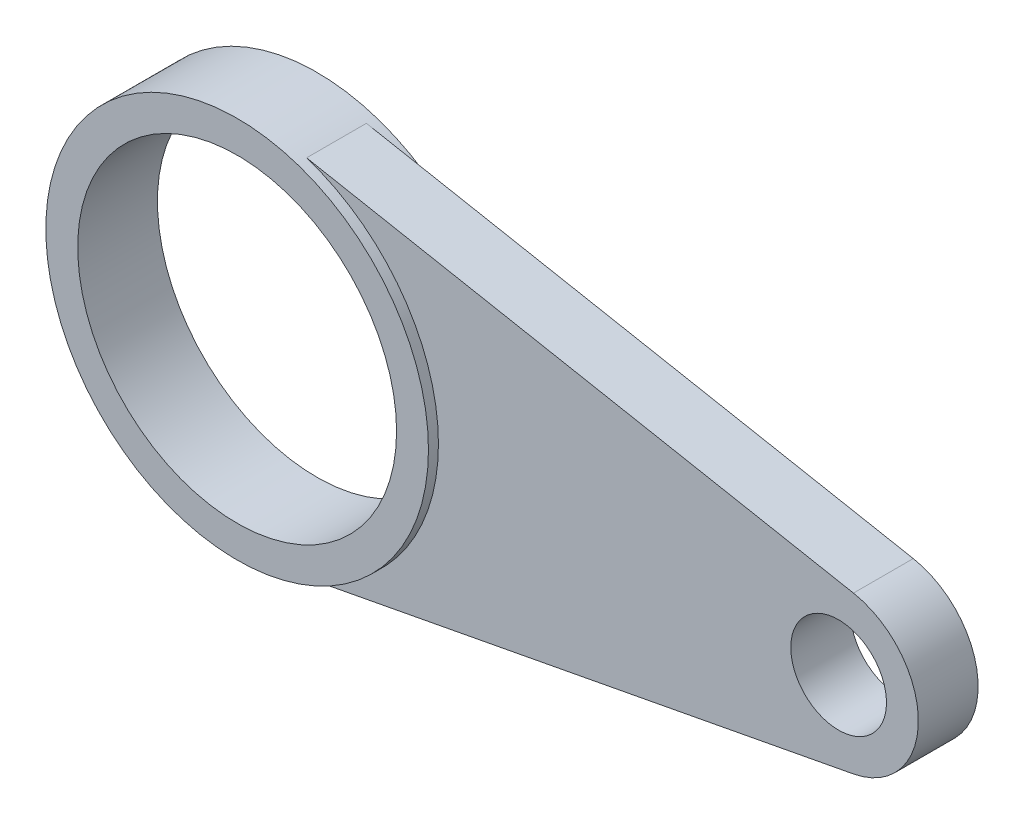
ISO-10303-21;
HEADER;
FILE_DESCRIPTION(('STEP AP214'),'2;1');
FILE_NAME('part.step','',(''),(''),'','','');
FILE_SCHEMA(('AUTOMOTIVE_DESIGN { 1 0 10303 214 1 1 1 1 }'));
ENDSEC;
DATA;
#1=APPLICATION_CONTEXT('core data for automotive mechanical design processes');
#2=APPLICATION_PROTOCOL_DEFINITION('international standard','automotive_design',2000,#1);
#3=PRODUCT_CONTEXT('',#1,'mechanical');
#4=PRODUCT('Part','Part','',(#3));
#5=PRODUCT_RELATED_PRODUCT_CATEGORY('part','',(#4));
#6=PRODUCT_DEFINITION_FORMATION('','',#4);
#7=PRODUCT_DEFINITION_CONTEXT('part definition',#1,'design');
#8=PRODUCT_DEFINITION('design','',#6,#7);
#9=PRODUCT_DEFINITION_SHAPE('','',#8);
#10=(LENGTH_UNIT() NAMED_UNIT(*) SI_UNIT(.MILLI.,.METRE.));
#11=(NAMED_UNIT(*) PLANE_ANGLE_UNIT() SI_UNIT($,.RADIAN.));
#12=(NAMED_UNIT(*) SI_UNIT($,.STERADIAN.) SOLID_ANGLE_UNIT());
#13=UNCERTAINTY_MEASURE_WITH_UNIT(LENGTH_MEASURE(1.E-05),#10,'distance_accuracy_value','');
#14=(GEOMETRIC_REPRESENTATION_CONTEXT(3) GLOBAL_UNCERTAINTY_ASSIGNED_CONTEXT((#13)) GLOBAL_UNIT_ASSIGNED_CONTEXT((#10,
#11,#12)) REPRESENTATION_CONTEXT('',''));
#15=CARTESIAN_POINT('',(0.,0.,0.));
#16=DIRECTION('',(0.,0.,1.));
#17=DIRECTION('',(1.,0.,0.));
#18=AXIS2_PLACEMENT_3D('',#15,#16,#17);
#19=CARTESIAN_POINT('',(0.,0.,6.35));
#20=DIRECTION('',(0.,0.,-1.));
#21=DIRECTION('',(-1.,0.,0.));
#22=AXIS2_PLACEMENT_3D('',#19,#20,#21);
#23=CYLINDRICAL_SURFACE('',#22,30.48);
#24=CARTESIAN_POINT('',(0.,0.,-6.35));
#25=DIRECTION('',(0.,0.,1.));
#26=DIRECTION('',(1.,0.,0.));
#27=AXIS2_PLACEMENT_3D('',#24,#25,#26);
#28=CIRCLE('',#27,30.48);
#29=CARTESIAN_POINT('',(30.48,0.,-6.35));
#30=VERTEX_POINT('',#29);
#31=EDGE_CURVE('E100',#30,#30,#28,.T.);
#32=ORIENTED_EDGE('',*,*,#31,.T.);
#33=EDGE_LOOP('',(#32));
#34=FACE_BOUND('',#33,.T.);
#35=CARTESIAN_POINT('',(0.,0.,6.35));
#36=DIRECTION('',(0.,0.,1.));
#37=DIRECTION('',(1.,0.,0.));
#38=AXIS2_PLACEMENT_3D('',#35,#36,#37);
#39=CIRCLE('',#38,30.48);
#40=CARTESIAN_POINT('',(30.48,0.,6.35));
#41=VERTEX_POINT('',#40);
#42=EDGE_CURVE('E102',#41,#41,#39,.T.);
#43=ORIENTED_EDGE('',*,*,#42,.F.);
#44=EDGE_LOOP('',(#43));
#45=FACE_BOUND('',#44,.T.);
#46=DIRECTION('',(0.,0.,-1.));
#47=VECTOR('',#46,1.);
#48=CARTESIAN_POINT('',(9.47978119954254,28.9683300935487,6.35));
#49=LINE('',#48,#47);
#50=CARTESIAN_POINT('',(9.47978119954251,28.9683300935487,-4.7625));
#51=VERTEX_POINT('',#50);
#52=CARTESIAN_POINT('',(9.47978119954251,28.9683300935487,4.7625));
#53=VERTEX_POINT('',#52);
#54=EDGE_CURVE('E11',#51,#53,#49,.F.);
#55=ORIENTED_EDGE('',*,*,#54,.F.);
#56=CARTESIAN_POINT('',(0.,0.,-4.7625));
#57=DIRECTION('',(0.,0.,1.));
#58=DIRECTION('',(1.,0.,0.));
#59=AXIS2_PLACEMENT_3D('',#56,#57,#58);
#60=CIRCLE('',#59,30.48);
#61=CARTESIAN_POINT('',(9.47978119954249,-28.9683300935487,-4.7625));
#62=VERTEX_POINT('',#61);
#63=EDGE_CURVE('E110',#62,#51,#60,.T.);
#64=ORIENTED_EDGE('',*,*,#63,.F.);
#65=DIRECTION('',(0.,0.,-1.));
#66=VECTOR('',#65,1.);
#67=CARTESIAN_POINT('',(9.47978119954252,-28.9683300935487,6.35));
#68=LINE('',#67,#66);
#69=CARTESIAN_POINT('',(9.47978119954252,-28.9683300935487,4.7625));
#70=VERTEX_POINT('',#69);
#71=EDGE_CURVE('E105',#70,#62,#68,.T.);
#72=ORIENTED_EDGE('',*,*,#71,.F.);
#73=CARTESIAN_POINT('',(0.,0.,4.7625));
#74=DIRECTION('',(0.,0.,1.));
#75=DIRECTION('',(1.,0.,0.));
#76=AXIS2_PLACEMENT_3D('',#73,#74,#75);
#77=CIRCLE('',#76,30.48);
#78=EDGE_CURVE('E39',#70,#53,#77,.T.);
#79=ORIENTED_EDGE('',*,*,#78,.T.);
#80=EDGE_LOOP('',(#55,#64,#72,#79));
#81=FACE_BOUND('',#80,.T.);
#82=ADVANCED_FACE('F32',(#34,#45,#81),#23,.T.);
#83=CARTESIAN_POINT('',(0.,0.,6.35));
#84=DIRECTION('',(0.,0.,1.));
#85=DIRECTION('',(1.,0.,0.));
#86=AXIS2_PLACEMENT_3D('',#83,#84,#85);
#87=PLANE('',#86);
#88=ORIENTED_EDGE('',*,*,#42,.T.);
#89=EDGE_LOOP('',(#88));
#90=FACE_BOUND('',#89,.T.);
#91=CARTESIAN_POINT('',(0.,0.,6.35));
#92=DIRECTION('',(0.,0.,1.));
#93=DIRECTION('',(1.,0.,0.));
#94=AXIS2_PLACEMENT_3D('',#91,#92,#93);
#95=CIRCLE('',#94,25.4);
#96=CARTESIAN_POINT('',(25.4,0.,6.35));
#97=VERTEX_POINT('',#96);
#98=EDGE_CURVE('E94',#97,#97,#95,.T.);
#99=ORIENTED_EDGE('',*,*,#98,.F.);
#100=EDGE_LOOP('',(#99));
#101=FACE_BOUND('',#100,.T.);
#102=ADVANCED_FACE('F141',(#90,#101),#87,.T.);
#103=CARTESIAN_POINT('',(0.,0.,-6.35));
#104=DIRECTION('',(0.,0.,1.));
#105=DIRECTION('',(1.,0.,0.));
#106=AXIS2_PLACEMENT_3D('',#103,#104,#105);
#107=PLANE('',#106);
#108=ORIENTED_EDGE('',*,*,#31,.F.);
#109=EDGE_LOOP('',(#108));
#110=FACE_BOUND('',#109,.T.);
#111=CARTESIAN_POINT('',(0.,0.,-6.35));
#112=DIRECTION('',(0.,0.,1.));
#113=DIRECTION('',(1.,0.,0.));
#114=AXIS2_PLACEMENT_3D('',#111,#112,#113);
#115=CIRCLE('',#114,25.4);
#116=CARTESIAN_POINT('',(25.4,0.,-6.35));
#117=VERTEX_POINT('',#116);
#118=EDGE_CURVE('E90',#117,#117,#115,.T.);
#119=ORIENTED_EDGE('',*,*,#118,.T.);
#120=EDGE_LOOP('',(#119));
#121=FACE_BOUND('',#120,.T.);
#122=ADVANCED_FACE('F146',(#110,#121),#107,.F.);
#123=CARTESIAN_POINT('',(0.,0.,6.35));
#124=DIRECTION('',(0.,0.,-1.));
#125=DIRECTION('',(-1.,0.,0.));
#126=AXIS2_PLACEMENT_3D('',#123,#124,#125);
#127=CYLINDRICAL_SURFACE('',#126,25.4);
#128=ORIENTED_EDGE('',*,*,#98,.T.);
#129=EDGE_LOOP('',(#128));
#130=FACE_BOUND('',#129,.T.);
#131=ORIENTED_EDGE('',*,*,#118,.F.);
#132=EDGE_LOOP('',(#131));
#133=FACE_BOUND('',#132,.T.);
#134=ADVANCED_FACE('F155',(#130,#133),#127,.F.);
#135=CARTESIAN_POINT('',(96.5959946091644,12.478420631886,4.7625));
#136=DIRECTION('',(-0.185983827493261,-0.982552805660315,0.));
#137=DIRECTION('',(0.982552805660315,-0.185983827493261,0.));
#138=AXIS2_PLACEMENT_3D('',#135,#136,#137);
#139=PLANE('',#138);
#140=DIRECTION('',(-0.982552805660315,0.185983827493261,0.));
#141=VECTOR('',#140,1.);
#142=CARTESIAN_POINT('',(96.5959946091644,12.478420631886,-4.7625));
#143=LINE('',#142,#141);
#144=CARTESIAN_POINT('',(96.5959946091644,12.478420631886,-4.7625));
#145=VERTEX_POINT('',#144);
#146=EDGE_CURVE('E115',#145,#51,#143,.T.);
#147=ORIENTED_EDGE('',*,*,#146,.T.);
#148=ORIENTED_EDGE('',*,*,#54,.T.);
#149=DIRECTION('',(-0.982552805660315,0.185983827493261,0.));
#150=VECTOR('',#149,1.);
#151=CARTESIAN_POINT('',(96.5959946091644,12.478420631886,4.7625));
#152=LINE('',#151,#150);
#153=CARTESIAN_POINT('',(96.5959946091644,12.478420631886,4.7625));
#154=VERTEX_POINT('',#153);
#155=EDGE_CURVE('E67',#154,#53,#152,.T.);
#156=ORIENTED_EDGE('',*,*,#155,.F.);
#157=DIRECTION('',(0.,0.,-1.));
#158=VECTOR('',#157,1.);
#159=CARTESIAN_POINT('',(96.5959946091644,12.478420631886,4.7625));
#160=LINE('',#159,#158);
#161=EDGE_CURVE('E72',#154,#145,#160,.T.);
#162=ORIENTED_EDGE('',*,*,#161,.T.);
#163=EDGE_LOOP('',(#147,#148,#156,#162));
#164=FACE_BOUND('',#163,.T.);
#165=ADVANCED_FACE('F70',(#164),#139,.F.);
#166=CARTESIAN_POINT('',(96.5959946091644,-12.478420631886,4.7625));
#167=DIRECTION('',(-0.185983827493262,0.982552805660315,0.));
#168=DIRECTION('',(-0.982552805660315,-0.185983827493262,0.));
#169=AXIS2_PLACEMENT_3D('',#166,#167,#168);
#170=PLANE('',#169);
#171=DIRECTION('',(0.982552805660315,0.185983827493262,0.));
#172=VECTOR('',#171,1.);
#173=CARTESIAN_POINT('',(96.5959946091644,-12.478420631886,4.7625));
#174=LINE('',#173,#172);
#175=CARTESIAN_POINT('',(96.5959946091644,-12.478420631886,4.7625));
#176=VERTEX_POINT('',#175);
#177=EDGE_CURVE('E75',#70,#176,#174,.T.);
#178=ORIENTED_EDGE('',*,*,#177,.F.);
#179=ORIENTED_EDGE('',*,*,#71,.T.);
#180=DIRECTION('',(0.982552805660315,0.185983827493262,0.));
#181=VECTOR('',#180,1.);
#182=CARTESIAN_POINT('',(96.5959946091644,-12.478420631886,-4.7625));
#183=LINE('',#182,#181);
#184=CARTESIAN_POINT('',(96.5959946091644,-12.478420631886,-4.7625));
#185=VERTEX_POINT('',#184);
#186=EDGE_CURVE('E85',#62,#185,#183,.T.);
#187=ORIENTED_EDGE('',*,*,#186,.T.);
#188=DIRECTION('',(0.,0.,-1.));
#189=VECTOR('',#188,1.);
#190=CARTESIAN_POINT('',(96.5959946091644,-12.478420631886,4.7625));
#191=LINE('',#190,#189);
#192=EDGE_CURVE('E91',#176,#185,#191,.T.);
#193=ORIENTED_EDGE('',*,*,#192,.F.);
#194=EDGE_LOOP('',(#178,#179,#187,#193));
#195=FACE_BOUND('',#194,.T.);
#196=ADVANCED_FACE('F130',(#195),#170,.F.);
#197=CARTESIAN_POINT('',(94.234,0.,4.7625));
#198=DIRECTION('',(0.,0.,1.));
#199=DIRECTION('',(1.,0.,0.));
#200=AXIS2_PLACEMENT_3D('',#197,#198,#199);
#201=PLANE('',#200);
#202=ORIENTED_EDGE('',*,*,#78,.F.);
#203=ORIENTED_EDGE('',*,*,#177,.T.);
#204=CARTESIAN_POINT('',(94.234,0.,4.7625));
#205=DIRECTION('',(0.,0.,1.));
#206=DIRECTION('',(1.,0.,0.));
#207=AXIS2_PLACEMENT_3D('',#204,#205,#206);
#208=CIRCLE('',#207,12.7);
#209=EDGE_CURVE('E76',#176,#154,#208,.T.);
#210=ORIENTED_EDGE('',*,*,#209,.T.);
#211=ORIENTED_EDGE('',*,*,#155,.T.);
#212=EDGE_LOOP('',(#202,#203,#210,#211));
#213=FACE_BOUND('',#212,.T.);
#214=CARTESIAN_POINT('',(94.234,0.,4.7625));
#215=DIRECTION('',(0.,0.,1.));
#216=DIRECTION('',(1.,0.,0.));
#217=AXIS2_PLACEMENT_3D('',#214,#215,#216);
#218=CIRCLE('',#217,7.62);
#219=CARTESIAN_POINT('',(86.614,0.,4.7625));
#220=VERTEX_POINT('',#219);
#221=EDGE_CURVE('E117',#220,#220,#218,.T.);
#222=ORIENTED_EDGE('',*,*,#221,.F.);
#223=EDGE_LOOP('',(#222));
#224=FACE_BOUND('',#223,.T.);
#225=ADVANCED_FACE('F79',(#213,#224),#201,.T.);
#226=CARTESIAN_POINT('',(94.234,0.,-4.7625));
#227=DIRECTION('',(0.,0.,1.));
#228=DIRECTION('',(1.,0.,0.));
#229=AXIS2_PLACEMENT_3D('',#226,#227,#228);
#230=PLANE('',#229);
#231=ORIENTED_EDGE('',*,*,#186,.F.);
#232=ORIENTED_EDGE('',*,*,#63,.T.);
#233=ORIENTED_EDGE('',*,*,#146,.F.);
#234=CARTESIAN_POINT('',(94.234,0.,-4.7625));
#235=DIRECTION('',(0.,0.,1.));
#236=DIRECTION('',(1.,0.,0.));
#237=AXIS2_PLACEMENT_3D('',#234,#235,#236);
#238=CIRCLE('',#237,12.7);
#239=EDGE_CURVE('E89',#185,#145,#238,.T.);
#240=ORIENTED_EDGE('',*,*,#239,.F.);
#241=EDGE_LOOP('',(#231,#232,#233,#240));
#242=FACE_BOUND('',#241,.T.);
#243=CARTESIAN_POINT('',(94.234,0.,-4.7625));
#244=DIRECTION('',(0.,0.,1.));
#245=DIRECTION('',(1.,0.,0.));
#246=AXIS2_PLACEMENT_3D('',#243,#244,#245);
#247=CIRCLE('',#246,7.62);
#248=CARTESIAN_POINT('',(86.614,0.,-4.7625));
#249=VERTEX_POINT('',#248);
#250=EDGE_CURVE('E121',#249,#249,#247,.T.);
#251=ORIENTED_EDGE('',*,*,#250,.T.);
#252=EDGE_LOOP('',(#251));
#253=FACE_BOUND('',#252,.T.);
#254=ADVANCED_FACE('F113',(#242,#253),#230,.F.);
#255=CARTESIAN_POINT('',(94.234,0.,4.7625));
#256=DIRECTION('',(0.,0.,-1.));
#257=DIRECTION('',(-1.,0.,0.));
#258=AXIS2_PLACEMENT_3D('',#255,#256,#257);
#259=CYLINDRICAL_SURFACE('',#258,12.7);
#260=ORIENTED_EDGE('',*,*,#239,.T.);
#261=ORIENTED_EDGE('',*,*,#161,.F.);
#262=ORIENTED_EDGE('',*,*,#209,.F.);
#263=ORIENTED_EDGE('',*,*,#192,.T.);
#264=EDGE_LOOP('',(#260,#261,#262,#263));
#265=FACE_BOUND('',#264,.T.);
#266=ADVANCED_FACE('F87',(#265),#259,.T.);
#267=CARTESIAN_POINT('',(94.234,0.,4.7625));
#268=DIRECTION('',(0.,0.,-1.));
#269=DIRECTION('',(-1.,0.,0.));
#270=AXIS2_PLACEMENT_3D('',#267,#268,#269);
#271=CYLINDRICAL_SURFACE('',#270,7.62);
#272=CARTESIAN_POINT('',(86.614,0.,4.7625));
#273=CARTESIAN_POINT('',(86.614,0.,4.66328125));
#274=CARTESIAN_POINT('',(86.614,0.,4.5640625));
#275=CARTESIAN_POINT('',(86.614,0.,4.365625));
#276=CARTESIAN_POINT('',(86.614,0.,4.26640625));
#277=CARTESIAN_POINT('',(86.614,0.,4.06796875));
#278=CARTESIAN_POINT('',(86.614,0.,3.96875));
#279=CARTESIAN_POINT('',(86.614,0.,3.7703125));
#280=CARTESIAN_POINT('',(86.614,0.,3.67109375));
#281=CARTESIAN_POINT('',(86.614,0.,3.47265625));
#282=CARTESIAN_POINT('',(86.614,0.,3.3734375));
#283=CARTESIAN_POINT('',(86.614,0.,3.175));
#284=CARTESIAN_POINT('',(86.614,0.,3.07578125));
#285=CARTESIAN_POINT('',(86.614,0.,2.87734375));
#286=CARTESIAN_POINT('',(86.614,0.,2.778125));
#287=CARTESIAN_POINT('',(86.614,0.,2.5796875));
#288=CARTESIAN_POINT('',(86.614,0.,2.48046875));
#289=CARTESIAN_POINT('',(86.614,0.,2.28203125));
#290=CARTESIAN_POINT('',(86.614,0.,2.1828125));
#291=CARTESIAN_POINT('',(86.614,0.,1.984375));
#292=CARTESIAN_POINT('',(86.614,0.,1.88515625));
#293=CARTESIAN_POINT('',(86.614,0.,1.68671875));
#294=CARTESIAN_POINT('',(86.614,0.,1.5875));
#295=CARTESIAN_POINT('',(86.614,0.,1.3890625));
#296=CARTESIAN_POINT('',(86.614,0.,1.28984375));
#297=CARTESIAN_POINT('',(86.614,0.,1.09140625));
#298=CARTESIAN_POINT('',(86.614,0.,0.992187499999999));
#299=CARTESIAN_POINT('',(86.614,0.,0.793749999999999));
#300=CARTESIAN_POINT('',(86.614,0.,0.694531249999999));
#301=CARTESIAN_POINT('',(86.614,0.,0.496093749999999));
#302=CARTESIAN_POINT('',(86.614,0.,0.396874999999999));
#303=CARTESIAN_POINT('',(86.614,0.,0.198437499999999));
#304=CARTESIAN_POINT('',(86.614,0.,0.0992187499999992));
#305=CARTESIAN_POINT('',(86.614,0.,-0.0992187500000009));
#306=CARTESIAN_POINT('',(86.614,0.,-0.198437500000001));
#307=CARTESIAN_POINT('',(86.614,0.,-0.396875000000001));
#308=CARTESIAN_POINT('',(86.614,0.,-0.496093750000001));
#309=CARTESIAN_POINT('',(86.614,0.,-0.694531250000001));
#310=CARTESIAN_POINT('',(86.614,0.,-0.793750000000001));
#311=CARTESIAN_POINT('',(86.614,0.,-0.992187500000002));
#312=CARTESIAN_POINT('',(86.614,0.,-1.09140625));
#313=CARTESIAN_POINT('',(86.614,0.,-1.28984375));
#314=CARTESIAN_POINT('',(86.614,0.,-1.3890625));
#315=CARTESIAN_POINT('',(86.614,0.,-1.5875));
#316=CARTESIAN_POINT('',(86.614,0.,-1.68671875));
#317=CARTESIAN_POINT('',(86.614,0.,-1.88515625));
#318=CARTESIAN_POINT('',(86.614,0.,-1.984375));
#319=CARTESIAN_POINT('',(86.614,0.,-2.1828125));
#320=CARTESIAN_POINT('',(86.614,0.,-2.28203125));
#321=CARTESIAN_POINT('',(86.614,0.,-2.48046875));
#322=CARTESIAN_POINT('',(86.614,0.,-2.5796875));
#323=CARTESIAN_POINT('',(86.614,0.,-2.778125));
#324=CARTESIAN_POINT('',(86.614,0.,-2.87734375));
#325=CARTESIAN_POINT('',(86.614,0.,-3.07578125));
#326=CARTESIAN_POINT('',(86.614,0.,-3.175));
#327=CARTESIAN_POINT('',(86.614,0.,-3.3734375));
#328=CARTESIAN_POINT('',(86.614,0.,-3.47265625));
#329=CARTESIAN_POINT('',(86.614,0.,-3.67109375));
#330=CARTESIAN_POINT('',(86.614,0.,-3.7703125));
#331=CARTESIAN_POINT('',(86.614,0.,-3.96875));
#332=CARTESIAN_POINT('',(86.614,0.,-4.06796875));
#333=CARTESIAN_POINT('',(86.614,0.,-4.26640625));
#334=CARTESIAN_POINT('',(86.614,0.,-4.365625));
#335=CARTESIAN_POINT('',(86.614,0.,-4.5640625));
#336=CARTESIAN_POINT('',(86.614,0.,-4.66328125));
#337=CARTESIAN_POINT('',(86.614,0.,-4.7625));
#338=B_SPLINE_CURVE_WITH_KNOTS('',3,(#272,#273,#274,#275,#276,#277,#278,#279,#280,#281,#282,
#283,#284,#285,#286,#287,#288,#289,#290,#291,#292,#293,#294,#295,#296,#297,#298,#299,#300,#301,
#302,#303,#304,#305,#306,#307,#308,#309,#310,#311,#312,#313,#314,#315,#316,#317,#318,#319,#320,
#321,#322,#323,#324,#325,#326,#327,#328,#329,#330,#331,#332,#333,#334,#335,#336,#337),
.UNSPECIFIED.,.F.,.F.,(4,2,2,2,2,2,2,2,2,2,2,2,2,2,2,2,2,2,2,2,2,2,2,2,2,2,2,2,2,2,2,2,4),(0.,
0.297656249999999,0.595312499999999,0.89296875,1.190625,1.48828125,1.7859375,2.08359375,2.38125,
2.67890625,2.9765625,3.27421875,3.571875,3.86953125,4.1671875,4.46484375,4.7625,5.06015625,
5.3578125,5.65546875,5.953125,6.25078125,6.5484375,6.84609375,7.14375,7.44140625,7.7390625,
8.03671875,8.334375,8.63203125,8.9296875,9.22734375,9.525),.UNSPECIFIED.);
#339=EDGE_CURVE('BSEAM127',#220,#249,#338,.T.);
#340=ORIENTED_EDGE('',*,*,#221,.T.);
#341=ORIENTED_EDGE('',*,*,#250,.F.);
#342=ORIENTED_EDGE('',*,*,#339,.T.);
#343=ORIENTED_EDGE('',*,*,#339,.F.);
#344=EDGE_LOOP('',(#340,#342,#341,#343));
#345=FACE_BOUND('',#344,.T.);
#346=ADVANCED_FACE('F127',(#345),#271,.F.);
#347=CLOSED_SHELL('',(#82,#102,#122,#134,#165,#196,#225,#254,#266,#346));
#348=MANIFOLD_SOLID_BREP('B2',#347);
#349=ADVANCED_BREP_SHAPE_REPRESENTATION('',(#18,#348),#14);
#350=SHAPE_DEFINITION_REPRESENTATION(#9,#349);
ENDSEC;
END-ISO-10303-21;
